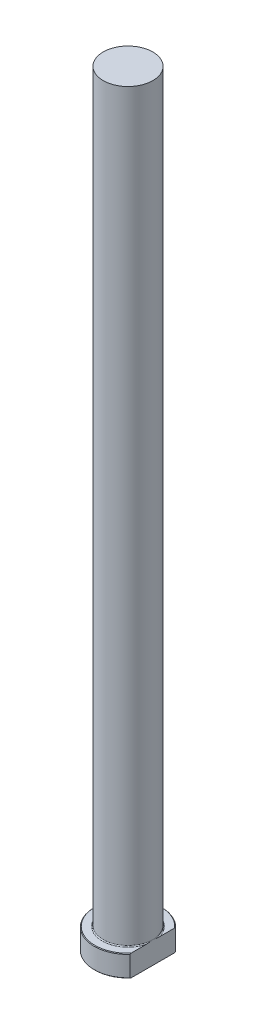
from build123d import *
from build123d.topology import SkipClean

# Parameters (mm, degrees)
CHAMFER1_SIZE = 0.2
FILLET1_R     = 0.3
KEY_DEPTH     = 251.483532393


with BuildPart() as part:
    # Sketch1 → Revolve1 (revolve)
    with BuildSketch(Plane.XY, mode=Mode.PRIVATE) as revolve1_sk:
        Polygon((0, 0), (-11, 0), (-11, 7), (-8.1, 7), (-8.1, 250), (0, 250), align=None)
    revolve(revolve1_sk.sketch.rotate(Axis((0, 259.958771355, 0), (0, -1, 0)), 270), axis=Axis((0, 259.958771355, 0), (0, -1, 0)))

    # Chamfer1
    chamfer1_edges = [part.edges().sort_by_distance(p)[0] for p in [
        (0, 7, -11),
        (0, 0, -11),
    ]]
    chamfer(chamfer1_edges, length=CHAMFER1_SIZE)

    # Fillet1
    fillet1_edges = [part.edges().sort_by_distance(p)[0] for p in [
        (0, 7, -8.1),
    ]]
    fillet(fillet1_edges, radius=FILLET1_R)

    # Sketch2 → KEY (cut, through all)
    with SkipClean():  # the faces are left unmerged after this step: merging them gives an invalid solid
        with BuildSketch(Plane(origin=(0, 0, 0), x_dir=(1, 0, 0), z_dir=(0, 1, 0))):
            with BuildLine():
                Line((8.1, 7.442445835), (8.1, -7.442445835))
                ThreePointArc((8.1, -7.442445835), (11, 0), (8.1, 7.442445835))
            make_face()
        extrude(amount=KEY_DEPTH, mode=Mode.SUBTRACT)


solid = part.part
